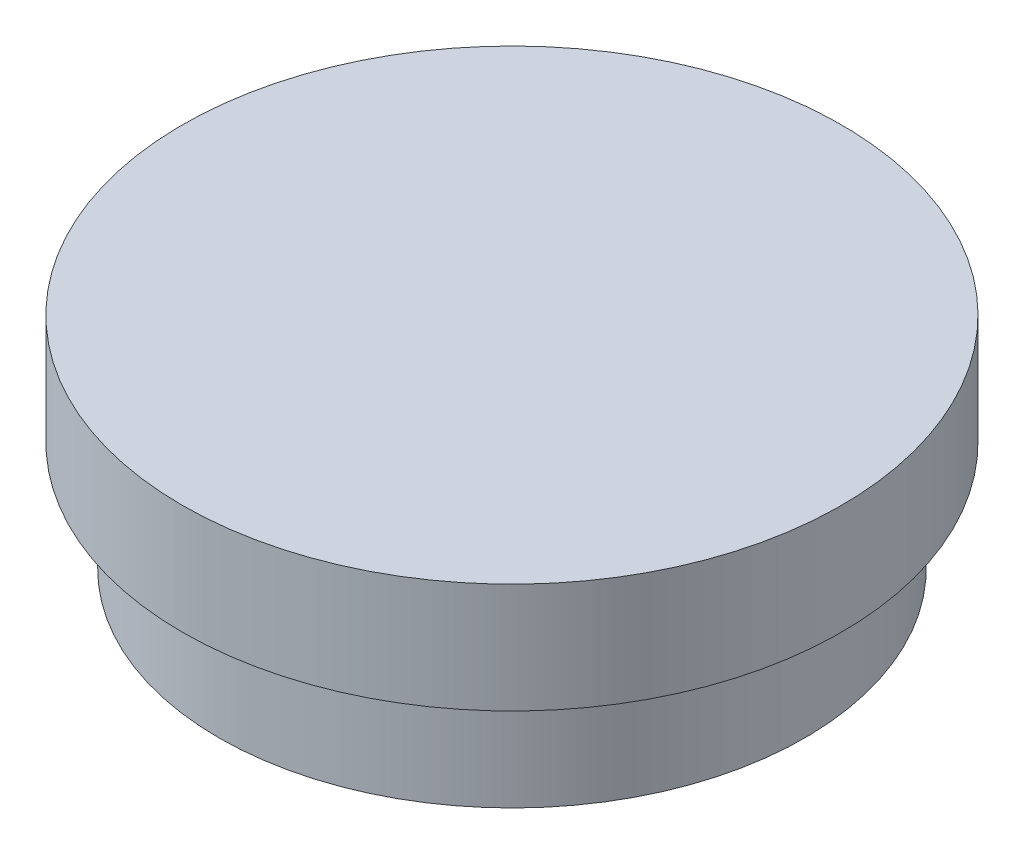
ISO-10303-21;
HEADER;
FILE_DESCRIPTION(('STEP AP214'),'2;1');
FILE_NAME('part.step','',(''),(''),'','','');
FILE_SCHEMA(('AUTOMOTIVE_DESIGN { 1 0 10303 214 1 1 1 1 }'));
ENDSEC;
DATA;
#1=APPLICATION_CONTEXT('core data for automotive mechanical design processes');
#2=APPLICATION_PROTOCOL_DEFINITION('international standard','automotive_design',2000,#1);
#3=PRODUCT_CONTEXT('',#1,'mechanical');
#4=PRODUCT('Part','Part','',(#3));
#5=PRODUCT_RELATED_PRODUCT_CATEGORY('part','',(#4));
#6=PRODUCT_DEFINITION_FORMATION('','',#4);
#7=PRODUCT_DEFINITION_CONTEXT('part definition',#1,'design');
#8=PRODUCT_DEFINITION('design','',#6,#7);
#9=PRODUCT_DEFINITION_SHAPE('','',#8);
#10=(LENGTH_UNIT() NAMED_UNIT(*) SI_UNIT(.MILLI.,.METRE.));
#11=(NAMED_UNIT(*) PLANE_ANGLE_UNIT() SI_UNIT($,.RADIAN.));
#12=(NAMED_UNIT(*) SI_UNIT($,.STERADIAN.) SOLID_ANGLE_UNIT());
#13=UNCERTAINTY_MEASURE_WITH_UNIT(LENGTH_MEASURE(1.E-05),#10,'distance_accuracy_value','');
#14=(GEOMETRIC_REPRESENTATION_CONTEXT(3) GLOBAL_UNCERTAINTY_ASSIGNED_CONTEXT((#13)) GLOBAL_UNIT_ASSIGNED_CONTEXT((#10,
#11,#12)) REPRESENTATION_CONTEXT('',''));
#15=CARTESIAN_POINT('',(0.,0.,0.));
#16=DIRECTION('',(0.,0.,1.));
#17=DIRECTION('',(1.,0.,0.));
#18=AXIS2_PLACEMENT_3D('',#15,#16,#17);
#19=CARTESIAN_POINT('',(0.,30.,0.));
#20=DIRECTION('',(0.,-1.,0.));
#21=DIRECTION('',(0.,0.,-1.));
#22=AXIS2_PLACEMENT_3D('',#19,#20,#21);
#23=CYLINDRICAL_SURFACE('',#22,80.);
#24=CARTESIAN_POINT('',(0.,30.,0.));
#25=DIRECTION('',(0.,1.,0.));
#26=DIRECTION('',(0.,0.,1.));
#27=AXIS2_PLACEMENT_3D('',#24,#25,#26);
#28=CIRCLE('',#27,80.);
#29=CARTESIAN_POINT('',(0.,30.,80.));
#30=VERTEX_POINT('',#29);
#31=EDGE_CURVE('E10',#30,#30,#28,.T.);
#32=ORIENTED_EDGE('',*,*,#31,.F.);
#33=EDGE_LOOP('',(#32));
#34=FACE_BOUND('',#33,.T.);
#35=CARTESIAN_POINT('',(0.,0.,0.));
#36=DIRECTION('',(0.,1.,0.));
#37=DIRECTION('',(0.,0.,1.));
#38=AXIS2_PLACEMENT_3D('',#35,#36,#37);
#39=CIRCLE('',#38,80.);
#40=CARTESIAN_POINT('',(0.,0.,80.));
#41=VERTEX_POINT('',#40);
#42=EDGE_CURVE('E40',#41,#41,#39,.T.);
#43=ORIENTED_EDGE('',*,*,#42,.T.);
#44=EDGE_LOOP('',(#43));
#45=FACE_BOUND('',#44,.T.);
#46=ADVANCED_FACE('F37',(#34,#45),#23,.T.);
#47=CARTESIAN_POINT('',(0.,0.,0.));
#48=DIRECTION('',(0.,1.,0.));
#49=DIRECTION('',(0.,0.,1.));
#50=AXIS2_PLACEMENT_3D('',#47,#48,#49);
#51=PLANE('',#50);
#52=ORIENTED_EDGE('',*,*,#42,.F.);
#53=EDGE_LOOP('',(#52));
#54=FACE_BOUND('',#53,.T.);
#55=ADVANCED_FACE('F60',(#54),#51,.F.);
#56=CARTESIAN_POINT('',(0.,60.,0.));
#57=DIRECTION('',(0.,-1.,0.));
#58=DIRECTION('',(0.,0.,-1.));
#59=AXIS2_PLACEMENT_3D('',#56,#57,#58);
#60=CYLINDRICAL_SURFACE('',#59,90.);
#61=CARTESIAN_POINT('',(0.,60.,0.));
#62=DIRECTION('',(0.,1.,0.));
#63=DIRECTION('',(0.,0.,1.));
#64=AXIS2_PLACEMENT_3D('',#61,#62,#63);
#65=CIRCLE('',#64,90.);
#66=CARTESIAN_POINT('',(0.,60.,90.));
#67=VERTEX_POINT('',#66);
#68=EDGE_CURVE('E47',#67,#67,#65,.T.);
#69=ORIENTED_EDGE('',*,*,#68,.F.);
#70=EDGE_LOOP('',(#69));
#71=FACE_BOUND('',#70,.T.);
#72=CARTESIAN_POINT('',(0.,30.,0.));
#73=DIRECTION('',(0.,1.,0.));
#74=DIRECTION('',(0.,0.,1.));
#75=AXIS2_PLACEMENT_3D('',#72,#73,#74);
#76=CIRCLE('',#75,90.);
#77=CARTESIAN_POINT('',(0.,30.,90.));
#78=VERTEX_POINT('',#77);
#79=EDGE_CURVE('E49',#78,#78,#76,.T.);
#80=ORIENTED_EDGE('',*,*,#79,.T.);
#81=EDGE_LOOP('',(#80));
#82=FACE_BOUND('',#81,.T.);
#83=ADVANCED_FACE('F57',(#71,#82),#60,.T.);
#84=CARTESIAN_POINT('',(0.,60.,0.));
#85=DIRECTION('',(0.,1.,0.));
#86=DIRECTION('',(0.,0.,1.));
#87=AXIS2_PLACEMENT_3D('',#84,#85,#86);
#88=PLANE('',#87);
#89=ORIENTED_EDGE('',*,*,#68,.T.);
#90=EDGE_LOOP('',(#89));
#91=FACE_BOUND('',#90,.T.);
#92=ADVANCED_FACE('F55',(#91),#88,.T.);
#93=CARTESIAN_POINT('',(0.,30.,0.));
#94=DIRECTION('',(0.,1.,0.));
#95=DIRECTION('',(0.,0.,1.));
#96=AXIS2_PLACEMENT_3D('',#93,#94,#95);
#97=PLANE('',#96);
#98=ORIENTED_EDGE('',*,*,#31,.T.);
#99=EDGE_LOOP('',(#98));
#100=FACE_BOUND('',#99,.T.);
#101=ORIENTED_EDGE('',*,*,#79,.F.);
#102=EDGE_LOOP('',(#101));
#103=FACE_BOUND('',#102,.T.);
#104=ADVANCED_FACE('F64',(#100,#103),#97,.F.);
#105=CLOSED_SHELL('',(#46,#55,#83,#92,#104));
#106=MANIFOLD_SOLID_BREP('B2',#105);
#107=ADVANCED_BREP_SHAPE_REPRESENTATION('',(#18,#106),#14);
#108=SHAPE_DEFINITION_REPRESENTATION(#9,#107);
ENDSEC;
END-ISO-10303-21;
